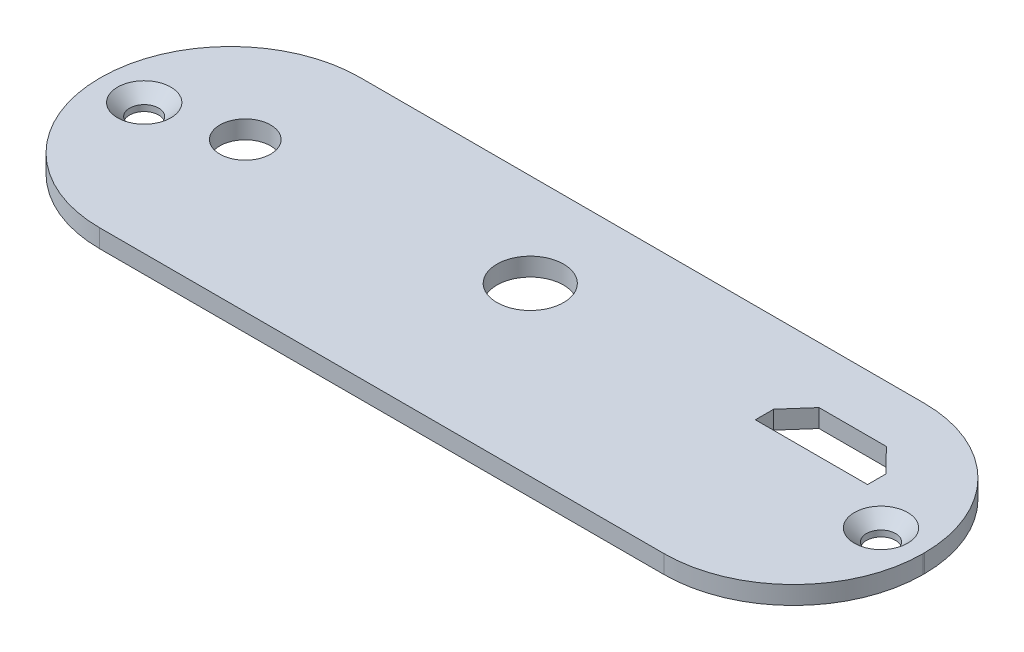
ISO-10303-21;
HEADER;
FILE_DESCRIPTION(('STEP AP214'),'2;1');
FILE_NAME('part.step','',(''),(''),'','','');
FILE_SCHEMA(('AUTOMOTIVE_DESIGN { 1 0 10303 214 1 1 1 1 }'));
ENDSEC;
DATA;
#1=APPLICATION_CONTEXT('core data for automotive mechanical design processes');
#2=APPLICATION_PROTOCOL_DEFINITION('international standard','automotive_design',2000,#1);
#3=PRODUCT_CONTEXT('',#1,'mechanical');
#4=PRODUCT('Part','Part','',(#3));
#5=PRODUCT_RELATED_PRODUCT_CATEGORY('part','',(#4));
#6=PRODUCT_DEFINITION_FORMATION('','',#4);
#7=PRODUCT_DEFINITION_CONTEXT('part definition',#1,'design');
#8=PRODUCT_DEFINITION('design','',#6,#7);
#9=PRODUCT_DEFINITION_SHAPE('','',#8);
#10=(LENGTH_UNIT() NAMED_UNIT(*) SI_UNIT(.MILLI.,.METRE.));
#11=(NAMED_UNIT(*) PLANE_ANGLE_UNIT() SI_UNIT($,.RADIAN.));
#12=(NAMED_UNIT(*) SI_UNIT($,.STERADIAN.) SOLID_ANGLE_UNIT());
#13=UNCERTAINTY_MEASURE_WITH_UNIT(LENGTH_MEASURE(1.E-05),#10,'distance_accuracy_value','');
#14=(GEOMETRIC_REPRESENTATION_CONTEXT(3) GLOBAL_UNCERTAINTY_ASSIGNED_CONTEXT((#13)) GLOBAL_UNIT_ASSIGNED_CONTEXT((#10,
#11,#12)) REPRESENTATION_CONTEXT('',''));
#15=CARTESIAN_POINT('',(0.,0.,0.));
#16=DIRECTION('',(0.,0.,1.));
#17=DIRECTION('',(1.,0.,0.));
#18=AXIS2_PLACEMENT_3D('',#15,#16,#17);
#19=CARTESIAN_POINT('',(10.7,1.5,-10.7));
#20=DIRECTION('',(0.,-1.,0.));
#21=DIRECTION('',(0.,0.,-1.));
#22=AXIS2_PLACEMENT_3D('',#19,#20,#21);
#23=CYLINDRICAL_SURFACE('',#22,10.7);
#24=CARTESIAN_POINT('',(10.7,0.,-10.7));
#25=DIRECTION('',(0.,1.,0.));
#26=DIRECTION('',(0.,0.,-1.));
#27=AXIS2_PLACEMENT_3D('',#24,#25,#26);
#28=CIRCLE('',#27,10.7);
#29=CARTESIAN_POINT('',(0.,0.,-10.7000000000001));
#30=VERTEX_POINT('',#29);
#31=CARTESIAN_POINT('',(10.7000000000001,0.,0.));
#32=VERTEX_POINT('',#31);
#33=EDGE_CURVE('E250',#30,#32,#28,.T.);
#34=ORIENTED_EDGE('',*,*,#33,.T.);
#35=DIRECTION('',(0.,-1.,0.));
#36=VECTOR('',#35,1.);
#37=CARTESIAN_POINT('',(10.7000000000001,1.5,0.));
#38=LINE('',#37,#36);
#39=CARTESIAN_POINT('',(10.7000000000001,1.5,0.));
#40=VERTEX_POINT('',#39);
#41=EDGE_CURVE('E11',#40,#32,#38,.T.);
#42=ORIENTED_EDGE('',*,*,#41,.F.);
#43=CARTESIAN_POINT('',(10.7,1.5,-10.7));
#44=DIRECTION('',(0.,1.,0.));
#45=DIRECTION('',(0.,0.,-1.));
#46=AXIS2_PLACEMENT_3D('',#43,#44,#45);
#47=CIRCLE('',#46,10.7);
#48=CARTESIAN_POINT('',(0.,1.5,-10.7000000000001));
#49=VERTEX_POINT('',#48);
#50=EDGE_CURVE('E251',#49,#40,#47,.T.);
#51=ORIENTED_EDGE('',*,*,#50,.F.);
#52=DIRECTION('',(0.,-1.,0.));
#53=VECTOR('',#52,1.);
#54=CARTESIAN_POINT('',(0.,1.5,-10.7000000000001));
#55=LINE('',#54,#53);
#56=EDGE_CURVE('E277',#49,#30,#55,.T.);
#57=ORIENTED_EDGE('',*,*,#56,.T.);
#58=EDGE_LOOP('',(#34,#42,#51,#57));
#59=FACE_BOUND('',#58,.T.);
#60=ADVANCED_FACE('F39',(#59),#23,.T.);
#61=CARTESIAN_POINT('',(10.7000000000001,1.5,0.));
#62=DIRECTION('',(0.,0.,-1.));
#63=DIRECTION('',(-1.,0.,0.));
#64=AXIS2_PLACEMENT_3D('',#61,#62,#63);
#65=PLANE('',#64);
#66=DIRECTION('',(1.,0.,0.));
#67=VECTOR('',#66,1.);
#68=CARTESIAN_POINT('',(10.7000000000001,0.,0.));
#69=LINE('',#68,#67);
#70=CARTESIAN_POINT('',(57.2999999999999,0.,0.));
#71=VERTEX_POINT('',#70);
#72=EDGE_CURVE('E281',#32,#71,#69,.T.);
#73=ORIENTED_EDGE('',*,*,#72,.T.);
#74=DIRECTION('',(0.,-1.,0.));
#75=VECTOR('',#74,1.);
#76=CARTESIAN_POINT('',(57.2999999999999,1.5,0.));
#77=LINE('',#76,#75);
#78=CARTESIAN_POINT('',(57.2999999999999,1.5,0.));
#79=VERTEX_POINT('',#78);
#80=EDGE_CURVE('E47',#79,#71,#77,.T.);
#81=ORIENTED_EDGE('',*,*,#80,.F.);
#82=DIRECTION('',(1.,0.,0.));
#83=VECTOR('',#82,1.);
#84=CARTESIAN_POINT('',(10.7000000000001,1.5,0.));
#85=LINE('',#84,#83);
#86=EDGE_CURVE('E255',#40,#79,#85,.T.);
#87=ORIENTED_EDGE('',*,*,#86,.F.);
#88=ORIENTED_EDGE('',*,*,#41,.T.);
#89=EDGE_LOOP('',(#73,#81,#87,#88));
#90=FACE_BOUND('',#89,.T.);
#91=ADVANCED_FACE('F351',(#90),#65,.F.);
#92=CARTESIAN_POINT('',(57.3,1.5,-10.7));
#93=DIRECTION('',(0.,-1.,0.));
#94=DIRECTION('',(0.,0.,-1.));
#95=AXIS2_PLACEMENT_3D('',#92,#93,#94);
#96=CYLINDRICAL_SURFACE('',#95,10.7);
#97=CARTESIAN_POINT('',(57.3,0.,-10.7));
#98=DIRECTION('',(0.,1.,0.));
#99=DIRECTION('',(0.,0.,1.));
#100=AXIS2_PLACEMENT_3D('',#97,#98,#99);
#101=CIRCLE('',#100,10.7);
#102=CARTESIAN_POINT('',(68.,0.,-10.7000000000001));
#103=VERTEX_POINT('',#102);
#104=EDGE_CURVE('E284',#71,#103,#101,.T.);
#105=ORIENTED_EDGE('',*,*,#104,.T.);
#106=DIRECTION('',(0.,-1.,0.));
#107=VECTOR('',#106,1.);
#108=CARTESIAN_POINT('',(68.,1.5,-10.7000000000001));
#109=LINE('',#108,#107);
#110=CARTESIAN_POINT('',(68.,1.5,-10.7000000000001));
#111=VERTEX_POINT('',#110);
#112=EDGE_CURVE('E320',#111,#103,#109,.T.);
#113=ORIENTED_EDGE('',*,*,#112,.F.);
#114=CARTESIAN_POINT('',(57.3,1.5,-10.7));
#115=DIRECTION('',(0.,1.,0.));
#116=DIRECTION('',(0.,0.,1.));
#117=AXIS2_PLACEMENT_3D('',#114,#115,#116);
#118=CIRCLE('',#117,10.7);
#119=EDGE_CURVE('E259',#79,#111,#118,.T.);
#120=ORIENTED_EDGE('',*,*,#119,.F.);
#121=ORIENTED_EDGE('',*,*,#80,.T.);
#122=EDGE_LOOP('',(#105,#113,#120,#121));
#123=FACE_BOUND('',#122,.T.);
#124=ADVANCED_FACE('F329',(#123),#96,.T.);
#125=CARTESIAN_POINT('',(68.,1.5,-10.7000000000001));
#126=DIRECTION('',(-1.,0.,0.));
#127=DIRECTION('',(0.,0.,1.));
#128=AXIS2_PLACEMENT_3D('',#125,#126,#127);
#129=PLANE('',#128);
#130=DIRECTION('',(0.,0.,-1.));
#131=VECTOR('',#130,1.);
#132=CARTESIAN_POINT('',(68.,0.,-10.7000000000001));
#133=LINE('',#132,#131);
#134=CARTESIAN_POINT('',(68.,0.,-10.7999999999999));
#135=VERTEX_POINT('',#134);
#136=EDGE_CURVE('E287',#103,#135,#133,.T.);
#137=ORIENTED_EDGE('',*,*,#136,.T.);
#138=DIRECTION('',(0.,-1.,0.));
#139=VECTOR('',#138,1.);
#140=CARTESIAN_POINT('',(68.,1.5,-10.7999999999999));
#141=LINE('',#140,#139);
#142=CARTESIAN_POINT('',(68.,1.5,-10.7999999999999));
#143=VERTEX_POINT('',#142);
#144=EDGE_CURVE('E316',#143,#135,#141,.T.);
#145=ORIENTED_EDGE('',*,*,#144,.F.);
#146=DIRECTION('',(0.,0.,-1.));
#147=VECTOR('',#146,1.);
#148=CARTESIAN_POINT('',(68.,1.5,-10.7000000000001));
#149=LINE('',#148,#147);
#150=EDGE_CURVE('E262',#111,#143,#149,.T.);
#151=ORIENTED_EDGE('',*,*,#150,.F.);
#152=ORIENTED_EDGE('',*,*,#112,.T.);
#153=EDGE_LOOP('',(#137,#145,#151,#152));
#154=FACE_BOUND('',#153,.T.);
#155=ADVANCED_FACE('F339',(#154),#129,.F.);
#156=CARTESIAN_POINT('',(57.3,1.5,-10.8));
#157=DIRECTION('',(0.,-1.,0.));
#158=DIRECTION('',(0.,0.,-1.));
#159=AXIS2_PLACEMENT_3D('',#156,#157,#158);
#160=CYLINDRICAL_SURFACE('',#159,10.7);
#161=CARTESIAN_POINT('',(57.3,0.,-10.8));
#162=DIRECTION('',(0.,1.,0.));
#163=DIRECTION('',(0.,0.,-1.));
#164=AXIS2_PLACEMENT_3D('',#161,#162,#163);
#165=CIRCLE('',#164,10.7);
#166=CARTESIAN_POINT('',(57.2999999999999,0.,-21.5));
#167=VERTEX_POINT('',#166);
#168=EDGE_CURVE('E290',#135,#167,#165,.T.);
#169=ORIENTED_EDGE('',*,*,#168,.T.);
#170=DIRECTION('',(0.,-1.,0.));
#171=VECTOR('',#170,1.);
#172=CARTESIAN_POINT('',(57.2999999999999,1.5,-21.5));
#173=LINE('',#172,#171);
#174=CARTESIAN_POINT('',(57.2999999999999,1.5,-21.5));
#175=VERTEX_POINT('',#174);
#176=EDGE_CURVE('E312',#175,#167,#173,.T.);
#177=ORIENTED_EDGE('',*,*,#176,.F.);
#178=CARTESIAN_POINT('',(57.3,1.5,-10.8));
#179=DIRECTION('',(0.,1.,0.));
#180=DIRECTION('',(0.,0.,-1.));
#181=AXIS2_PLACEMENT_3D('',#178,#179,#180);
#182=CIRCLE('',#181,10.7);
#183=EDGE_CURVE('E265',#143,#175,#182,.T.);
#184=ORIENTED_EDGE('',*,*,#183,.F.);
#185=ORIENTED_EDGE('',*,*,#144,.T.);
#186=EDGE_LOOP('',(#169,#177,#184,#185));
#187=FACE_BOUND('',#186,.T.);
#188=ADVANCED_FACE('F343',(#187),#160,.T.);
#189=CARTESIAN_POINT('',(10.7000000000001,1.5,-21.5));
#190=DIRECTION('',(0.,0.,1.));
#191=DIRECTION('',(1.,0.,0.));
#192=AXIS2_PLACEMENT_3D('',#189,#190,#191);
#193=PLANE('',#192);
#194=DIRECTION('',(-1.,0.,0.));
#195=VECTOR('',#194,1.);
#196=CARTESIAN_POINT('',(10.7000000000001,0.,-21.5));
#197=LINE('',#196,#195);
#198=CARTESIAN_POINT('',(10.7000000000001,0.,-21.5));
#199=VERTEX_POINT('',#198);
#200=EDGE_CURVE('E293',#167,#199,#197,.T.);
#201=ORIENTED_EDGE('',*,*,#200,.T.);
#202=DIRECTION('',(0.,-1.,0.));
#203=VECTOR('',#202,1.);
#204=CARTESIAN_POINT('',(10.7000000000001,1.5,-21.5));
#205=LINE('',#204,#203);
#206=CARTESIAN_POINT('',(10.7000000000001,1.5,-21.5));
#207=VERTEX_POINT('',#206);
#208=EDGE_CURVE('E308',#207,#199,#205,.T.);
#209=ORIENTED_EDGE('',*,*,#208,.F.);
#210=DIRECTION('',(-1.,0.,0.));
#211=VECTOR('',#210,1.);
#212=CARTESIAN_POINT('',(10.7000000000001,1.5,-21.5));
#213=LINE('',#212,#211);
#214=EDGE_CURVE('E268',#175,#207,#213,.T.);
#215=ORIENTED_EDGE('',*,*,#214,.F.);
#216=ORIENTED_EDGE('',*,*,#176,.T.);
#217=EDGE_LOOP('',(#201,#209,#215,#216));
#218=FACE_BOUND('',#217,.T.);
#219=ADVANCED_FACE('F364',(#218),#193,.F.);
#220=CARTESIAN_POINT('',(10.7,1.5,-10.8));
#221=DIRECTION('',(0.,-1.,0.));
#222=DIRECTION('',(0.,0.,-1.));
#223=AXIS2_PLACEMENT_3D('',#220,#221,#222);
#224=CYLINDRICAL_SURFACE('',#223,10.7);
#225=CARTESIAN_POINT('',(10.7,0.,-10.8));
#226=DIRECTION('',(0.,1.,0.));
#227=DIRECTION('',(0.,0.,-1.));
#228=AXIS2_PLACEMENT_3D('',#225,#226,#227);
#229=CIRCLE('',#228,10.7);
#230=CARTESIAN_POINT('',(0.,0.,-10.7999999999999));
#231=VERTEX_POINT('',#230);
#232=EDGE_CURVE('E296',#199,#231,#229,.T.);
#233=ORIENTED_EDGE('',*,*,#232,.T.);
#234=DIRECTION('',(0.,-1.,0.));
#235=VECTOR('',#234,1.);
#236=CARTESIAN_POINT('',(0.,1.5,-10.7999999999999));
#237=LINE('',#236,#235);
#238=CARTESIAN_POINT('',(0.,1.5,-10.7999999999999));
#239=VERTEX_POINT('',#238);
#240=EDGE_CURVE('E304',#239,#231,#237,.T.);
#241=ORIENTED_EDGE('',*,*,#240,.F.);
#242=CARTESIAN_POINT('',(10.7,1.5,-10.8));
#243=DIRECTION('',(0.,1.,0.));
#244=DIRECTION('',(0.,0.,-1.));
#245=AXIS2_PLACEMENT_3D('',#242,#243,#244);
#246=CIRCLE('',#245,10.7);
#247=EDGE_CURVE('E271',#207,#239,#246,.T.);
#248=ORIENTED_EDGE('',*,*,#247,.F.);
#249=ORIENTED_EDGE('',*,*,#208,.T.);
#250=EDGE_LOOP('',(#233,#241,#248,#249));
#251=FACE_BOUND('',#250,.T.);
#252=ADVANCED_FACE('F362',(#251),#224,.T.);
#253=CARTESIAN_POINT('',(0.,1.5,-10.7000000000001));
#254=DIRECTION('',(1.,0.,0.));
#255=DIRECTION('',(0.,0.,-1.));
#256=AXIS2_PLACEMENT_3D('',#253,#254,#255);
#257=PLANE('',#256);
#258=DIRECTION('',(0.,0.,1.));
#259=VECTOR('',#258,1.);
#260=CARTESIAN_POINT('',(0.,0.,-10.7000000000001));
#261=LINE('',#260,#259);
#262=EDGE_CURVE('E256',#231,#30,#261,.T.);
#263=ORIENTED_EDGE('',*,*,#262,.T.);
#264=ORIENTED_EDGE('',*,*,#56,.F.);
#265=DIRECTION('',(0.,0.,1.));
#266=VECTOR('',#265,1.);
#267=CARTESIAN_POINT('',(0.,1.5,-10.7000000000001));
#268=LINE('',#267,#266);
#269=EDGE_CURVE('E274',#239,#49,#268,.T.);
#270=ORIENTED_EDGE('',*,*,#269,.F.);
#271=ORIENTED_EDGE('',*,*,#240,.T.);
#272=EDGE_LOOP('',(#263,#264,#270,#271));
#273=FACE_BOUND('',#272,.T.);
#274=ADVANCED_FACE('F357',(#273),#257,.F.);
#275=CARTESIAN_POINT('',(10.7,1.5,-10.7));
#276=DIRECTION('',(0.,-1.,0.));
#277=DIRECTION('',(0.,0.,-1.));
#278=AXIS2_PLACEMENT_3D('',#275,#276,#277);
#279=PLANE('',#278);
#280=DIRECTION('',(0.,0.,1.));
#281=VECTOR('',#280,1.);
#282=CARTESIAN_POINT('',(51.5046246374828,1.5,-13.3410056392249));
#283=LINE('',#282,#281);
#284=CARTESIAN_POINT('',(51.5046246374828,1.5,-14.8527326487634));
#285=VERTEX_POINT('',#284);
#286=CARTESIAN_POINT('',(51.5046246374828,1.5,-13.3410056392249));
#287=VERTEX_POINT('',#286);
#288=EDGE_CURVE('E182',#285,#287,#283,.T.);
#289=ORIENTED_EDGE('',*,*,#288,.F.);
#290=DIRECTION('',(-0.661343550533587,0.,0.750083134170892));
#291=VECTOR('',#290,1.);
#292=CARTESIAN_POINT('',(53.2602628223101,1.5,-16.8439437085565));
#293=LINE('',#292,#291);
#294=CARTESIAN_POINT('',(53.2602628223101,1.5,-16.8439437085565));
#295=VERTEX_POINT('',#294);
#296=EDGE_CURVE('E54',#295,#285,#293,.T.);
#297=ORIENTED_EDGE('',*,*,#296,.F.);
#298=DIRECTION('',(-1.,0.,0.));
#299=VECTOR('',#298,1.);
#300=CARTESIAN_POINT('',(53.2602628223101,1.5,-16.8439437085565));
#301=LINE('',#300,#299);
#302=CARTESIAN_POINT('',(58.8233118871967,1.5,-16.8439437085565));
#303=VERTEX_POINT('',#302);
#304=EDGE_CURVE('E162',#303,#295,#301,.T.);
#305=ORIENTED_EDGE('',*,*,#304,.F.);
#306=DIRECTION('',(-0.698847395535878,0.,-0.715270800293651));
#307=VECTOR('',#306,1.);
#308=CARTESIAN_POINT('',(60.7688025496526,1.5,-14.8527326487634));
#309=LINE('',#308,#307);
#310=CARTESIAN_POINT('',(60.7688025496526,1.5,-14.8527326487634));
#311=VERTEX_POINT('',#310);
#312=EDGE_CURVE('E166',#311,#303,#309,.T.);
#313=ORIENTED_EDGE('',*,*,#312,.F.);
#314=DIRECTION('',(0.,0.,-1.));
#315=VECTOR('',#314,1.);
#316=CARTESIAN_POINT('',(60.7688025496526,1.5,-13.3410056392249));
#317=LINE('',#316,#315);
#318=CARTESIAN_POINT('',(60.7688025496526,1.5,-13.3410056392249));
#319=VERTEX_POINT('',#318);
#320=EDGE_CURVE('E190',#319,#311,#317,.T.);
#321=ORIENTED_EDGE('',*,*,#320,.F.);
#322=DIRECTION('',(1.,0.,0.));
#323=VECTOR('',#322,1.);
#324=CARTESIAN_POINT('',(60.7688025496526,1.5,-13.3410056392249));
#325=LINE('',#324,#323);
#326=EDGE_CURVE('E186',#287,#319,#325,.T.);
#327=ORIENTED_EDGE('',*,*,#326,.F.);
#328=EDGE_LOOP('',(#289,#297,#305,#313,#321,#327));
#329=FACE_BOUND('',#328,.T.);
#330=CARTESIAN_POINT('',(32.451482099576,1.5,-13.8069141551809));
#331=DIRECTION('',(0.,1.,0.));
#332=DIRECTION('',(0.,0.,1.));
#333=AXIS2_PLACEMENT_3D('',#330,#331,#332);
#334=CIRCLE('',#333,2.75154575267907);
#335=CARTESIAN_POINT('',(32.451482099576,1.5,-11.0553684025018));
#336=VERTEX_POINT('',#335);
#337=EDGE_CURVE('E215',#336,#336,#334,.T.);
#338=ORIENTED_EDGE('',*,*,#337,.F.);
#339=EDGE_LOOP('',(#338));
#340=FACE_BOUND('',#339,.T.);
#341=CARTESIAN_POINT('',(10.4,1.5,-12.32139708));
#342=DIRECTION('',(0.,1.,0.));
#343=DIRECTION('',(0.,0.,1.));
#344=AXIS2_PLACEMENT_3D('',#341,#342,#343);
#345=CIRCLE('',#344,2.09258907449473);
#346=CARTESIAN_POINT('',(10.4,1.5,-10.2288080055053));
#347=VERTEX_POINT('',#346);
#348=EDGE_CURVE('E223',#347,#347,#345,.T.);
#349=ORIENTED_EDGE('',*,*,#348,.F.);
#350=EDGE_LOOP('',(#349));
#351=FACE_BOUND('',#350,.T.);
#352=CARTESIAN_POINT('',(3.57803634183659,1.5,-10.7999999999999));
#353=DIRECTION('',(0.,1.,0.));
#354=DIRECTION('',(0.,0.,1.));
#355=AXIS2_PLACEMENT_3D('',#352,#353,#354);
#356=CIRCLE('',#355,2.2);
#357=CARTESIAN_POINT('',(3.57803634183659,1.5,-8.59999999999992));
#358=VERTEX_POINT('',#357);
#359=EDGE_CURVE('E200',#358,#358,#356,.T.);
#360=ORIENTED_EDGE('',*,*,#359,.F.);
#361=EDGE_LOOP('',(#360));
#362=FACE_BOUND('',#361,.T.);
#363=CARTESIAN_POINT('',(64.42357397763,1.5,-10.7999999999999));
#364=DIRECTION('',(0.,1.,0.));
#365=DIRECTION('',(0.,0.,1.));
#366=AXIS2_PLACEMENT_3D('',#363,#364,#365);
#367=CIRCLE('',#366,2.19999999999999);
#368=CARTESIAN_POINT('',(64.42357397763,1.5,-8.59999999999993));
#369=VERTEX_POINT('',#368);
#370=EDGE_CURVE('E238',#369,#369,#367,.T.);
#371=ORIENTED_EDGE('',*,*,#370,.F.);
#372=EDGE_LOOP('',(#371));
#373=FACE_BOUND('',#372,.T.);
#374=ORIENTED_EDGE('',*,*,#50,.T.);
#375=ORIENTED_EDGE('',*,*,#86,.T.);
#376=ORIENTED_EDGE('',*,*,#119,.T.);
#377=ORIENTED_EDGE('',*,*,#150,.T.);
#378=ORIENTED_EDGE('',*,*,#183,.T.);
#379=ORIENTED_EDGE('',*,*,#214,.T.);
#380=ORIENTED_EDGE('',*,*,#247,.T.);
#381=ORIENTED_EDGE('',*,*,#269,.T.);
#382=EDGE_LOOP('',(#374,#375,#376,#377,#378,#379,#380,#381));
#383=FACE_BOUND('',#382,.T.);
#384=ADVANCED_FACE('F347',(#329,#340,#351,#362,#373,#383),#279,.F.);
#385=CARTESIAN_POINT('',(10.7,0.,-10.7));
#386=DIRECTION('',(0.,-1.,0.));
#387=DIRECTION('',(0.,0.,-1.));
#388=AXIS2_PLACEMENT_3D('',#385,#386,#387);
#389=PLANE('',#388);
#390=DIRECTION('',(-0.661343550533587,0.,0.750083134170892));
#391=VECTOR('',#390,1.);
#392=CARTESIAN_POINT('',(53.2602628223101,0.,-16.8439437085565));
#393=LINE('',#392,#391);
#394=CARTESIAN_POINT('',(53.2602628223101,0.,-16.8439437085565));
#395=VERTEX_POINT('',#394);
#396=CARTESIAN_POINT('',(51.5046246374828,0.,-14.8527326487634));
#397=VERTEX_POINT('',#396);
#398=EDGE_CURVE('E142',#395,#397,#393,.T.);
#399=ORIENTED_EDGE('',*,*,#398,.T.);
#400=DIRECTION('',(0.,0.,1.));
#401=VECTOR('',#400,1.);
#402=CARTESIAN_POINT('',(51.5046246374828,0.,-13.3410056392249));
#403=LINE('',#402,#401);
#404=CARTESIAN_POINT('',(51.5046246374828,0.,-13.3410056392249));
#405=VERTEX_POINT('',#404);
#406=EDGE_CURVE('E152',#397,#405,#403,.T.);
#407=ORIENTED_EDGE('',*,*,#406,.T.);
#408=DIRECTION('',(1.,0.,0.));
#409=VECTOR('',#408,1.);
#410=CARTESIAN_POINT('',(60.7688025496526,0.,-13.3410056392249));
#411=LINE('',#410,#409);
#412=CARTESIAN_POINT('',(60.7688025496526,0.,-13.3410056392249));
#413=VERTEX_POINT('',#412);
#414=EDGE_CURVE('E62',#405,#413,#411,.T.);
#415=ORIENTED_EDGE('',*,*,#414,.T.);
#416=DIRECTION('',(0.,0.,-1.));
#417=VECTOR('',#416,1.);
#418=CARTESIAN_POINT('',(60.7688025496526,0.,-13.3410056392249));
#419=LINE('',#418,#417);
#420=CARTESIAN_POINT('',(60.7688025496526,0.,-14.8527326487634));
#421=VERTEX_POINT('',#420);
#422=EDGE_CURVE('E171',#413,#421,#419,.T.);
#423=ORIENTED_EDGE('',*,*,#422,.T.);
#424=DIRECTION('',(-0.698847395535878,0.,-0.715270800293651));
#425=VECTOR('',#424,1.);
#426=CARTESIAN_POINT('',(60.7688025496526,0.,-14.8527326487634));
#427=LINE('',#426,#425);
#428=CARTESIAN_POINT('',(58.8233118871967,0.,-16.8439437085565));
#429=VERTEX_POINT('',#428);
#430=EDGE_CURVE('E175',#421,#429,#427,.T.);
#431=ORIENTED_EDGE('',*,*,#430,.T.);
#432=DIRECTION('',(-1.,0.,0.));
#433=VECTOR('',#432,1.);
#434=CARTESIAN_POINT('',(53.2602628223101,0.,-16.8439437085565));
#435=LINE('',#434,#433);
#436=EDGE_CURVE('E149',#429,#395,#435,.T.);
#437=ORIENTED_EDGE('',*,*,#436,.T.);
#438=EDGE_LOOP('',(#399,#407,#415,#423,#431,#437));
#439=FACE_BOUND('',#438,.T.);
#440=CARTESIAN_POINT('',(32.451482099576,0.,-13.8069141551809));
#441=DIRECTION('',(0.,1.,0.));
#442=DIRECTION('',(0.,0.,1.));
#443=AXIS2_PLACEMENT_3D('',#440,#441,#442);
#444=CIRCLE('',#443,2.75154575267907);
#445=CARTESIAN_POINT('',(32.451482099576,0.,-11.0553684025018));
#446=VERTEX_POINT('',#445);
#447=EDGE_CURVE('E183',#446,#446,#444,.T.);
#448=ORIENTED_EDGE('',*,*,#447,.T.);
#449=EDGE_LOOP('',(#448));
#450=FACE_BOUND('',#449,.T.);
#451=CARTESIAN_POINT('',(10.4,0.,-12.32139708));
#452=DIRECTION('',(0.,1.,0.));
#453=DIRECTION('',(0.,0.,1.));
#454=AXIS2_PLACEMENT_3D('',#451,#452,#453);
#455=CIRCLE('',#454,2.09258907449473);
#456=CARTESIAN_POINT('',(10.4,0.,-10.2288080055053));
#457=VERTEX_POINT('',#456);
#458=EDGE_CURVE('E219',#457,#457,#455,.T.);
#459=ORIENTED_EDGE('',*,*,#458,.T.);
#460=EDGE_LOOP('',(#459));
#461=FACE_BOUND('',#460,.T.);
#462=CARTESIAN_POINT('',(3.57803634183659,0.,-10.7999999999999));
#463=DIRECTION('',(0.,1.,0.));
#464=DIRECTION('',(0.,0.,1.));
#465=AXIS2_PLACEMENT_3D('',#462,#463,#464);
#466=CIRCLE('',#465,1.2);
#467=CARTESIAN_POINT('',(3.57803634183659,0.,-9.59999999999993));
#468=VERTEX_POINT('',#467);
#469=EDGE_CURVE('E234',#468,#468,#466,.T.);
#470=ORIENTED_EDGE('',*,*,#469,.T.);
#471=EDGE_LOOP('',(#470));
#472=FACE_BOUND('',#471,.T.);
#473=CARTESIAN_POINT('',(64.42357397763,0.,-10.7999999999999));
#474=DIRECTION('',(0.,1.,0.));
#475=DIRECTION('',(0.,0.,1.));
#476=AXIS2_PLACEMENT_3D('',#473,#474,#475);
#477=CIRCLE('',#476,1.19999999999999);
#478=CARTESIAN_POINT('',(64.42357397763,0.,-9.59999999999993));
#479=VERTEX_POINT('',#478);
#480=EDGE_CURVE('E246',#479,#479,#477,.T.);
#481=ORIENTED_EDGE('',*,*,#480,.T.);
#482=EDGE_LOOP('',(#481));
#483=FACE_BOUND('',#482,.T.);
#484=ORIENTED_EDGE('',*,*,#33,.F.);
#485=ORIENTED_EDGE('',*,*,#262,.F.);
#486=ORIENTED_EDGE('',*,*,#232,.F.);
#487=ORIENTED_EDGE('',*,*,#200,.F.);
#488=ORIENTED_EDGE('',*,*,#168,.F.);
#489=ORIENTED_EDGE('',*,*,#136,.F.);
#490=ORIENTED_EDGE('',*,*,#104,.F.);
#491=ORIENTED_EDGE('',*,*,#72,.F.);
#492=EDGE_LOOP('',(#484,#485,#486,#487,#488,#489,#490,#491));
#493=FACE_BOUND('',#492,.T.);
#494=ADVANCED_FACE('F157',(#439,#450,#461,#472,#483,#493),#389,.T.);
#495=CARTESIAN_POINT('',(64.42357397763,1.5,-10.7999999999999));
#496=DIRECTION('',(0.,1.,0.));
#497=DIRECTION('',(0.,0.,1.));
#498=AXIS2_PLACEMENT_3D('',#495,#496,#497);
#499=CYLINDRICAL_SURFACE('',#498,1.19999999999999);
#500=ORIENTED_EDGE('',*,*,#480,.F.);
#501=EDGE_LOOP('',(#500));
#502=FACE_BOUND('',#501,.T.);
#503=CARTESIAN_POINT('',(64.42357397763,0.499999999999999,-10.7999999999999));
#504=DIRECTION('',(0.,1.,0.));
#505=DIRECTION('',(0.,0.,1.));
#506=AXIS2_PLACEMENT_3D('',#503,#504,#505);
#507=CIRCLE('',#506,1.19999999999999);
#508=CARTESIAN_POINT('',(64.42357397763,0.499999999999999,-9.59999999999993));
#509=VERTEX_POINT('',#508);
#510=EDGE_CURVE('E242',#509,#509,#507,.T.);
#511=ORIENTED_EDGE('',*,*,#510,.T.);
#512=EDGE_LOOP('',(#511));
#513=FACE_BOUND('',#512,.T.);
#514=ADVANCED_FACE('F416',(#502,#513),#499,.F.);
#515=CARTESIAN_POINT('',(64.42357397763,1.5,-10.7999999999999));
#516=DIRECTION('',(0.,1.,0.));
#517=DIRECTION('',(0.,0.,1.));
#518=AXIS2_PLACEMENT_3D('',#515,#516,#517);
#519=CONICAL_SURFACE('',#518,2.19999999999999,0.785398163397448);
#520=ORIENTED_EDGE('',*,*,#510,.F.);
#521=EDGE_LOOP('',(#520));
#522=FACE_BOUND('',#521,.T.);
#523=ORIENTED_EDGE('',*,*,#370,.T.);
#524=EDGE_LOOP('',(#523));
#525=FACE_BOUND('',#524,.T.);
#526=ADVANCED_FACE('F421',(#522,#525),#519,.F.);
#527=CARTESIAN_POINT('',(3.57803634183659,1.5,-10.7999999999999));
#528=DIRECTION('',(0.,1.,0.));
#529=DIRECTION('',(0.,0.,1.));
#530=AXIS2_PLACEMENT_3D('',#527,#528,#529);
#531=CYLINDRICAL_SURFACE('',#530,1.2);
#532=ORIENTED_EDGE('',*,*,#469,.F.);
#533=EDGE_LOOP('',(#532));
#534=FACE_BOUND('',#533,.T.);
#535=CARTESIAN_POINT('',(3.57803634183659,0.499999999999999,-10.7999999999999));
#536=DIRECTION('',(0.,1.,0.));
#537=DIRECTION('',(0.,0.,1.));
#538=AXIS2_PLACEMENT_3D('',#535,#536,#537);
#539=CIRCLE('',#538,1.2);
#540=CARTESIAN_POINT('',(3.57803634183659,0.499999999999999,-9.59999999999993));
#541=VERTEX_POINT('',#540);
#542=EDGE_CURVE('E230',#541,#541,#539,.T.);
#543=ORIENTED_EDGE('',*,*,#542,.T.);
#544=EDGE_LOOP('',(#543));
#545=FACE_BOUND('',#544,.T.);
#546=ADVANCED_FACE('F433',(#534,#545),#531,.F.);
#547=CARTESIAN_POINT('',(3.57803634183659,1.5,-10.7999999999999));
#548=DIRECTION('',(0.,1.,0.));
#549=DIRECTION('',(0.,0.,1.));
#550=AXIS2_PLACEMENT_3D('',#547,#548,#549);
#551=CONICAL_SURFACE('',#550,2.2,0.785398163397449);
#552=ORIENTED_EDGE('',*,*,#542,.F.);
#553=EDGE_LOOP('',(#552));
#554=FACE_BOUND('',#553,.T.);
#555=ORIENTED_EDGE('',*,*,#359,.T.);
#556=EDGE_LOOP('',(#555));
#557=FACE_BOUND('',#556,.T.);
#558=ADVANCED_FACE('F443',(#554,#557),#551,.F.);
#559=CARTESIAN_POINT('',(10.4,0.,-12.32139708));
#560=DIRECTION('',(0.,1.,0.));
#561=DIRECTION('',(0.,0.,1.));
#562=AXIS2_PLACEMENT_3D('',#559,#560,#561);
#563=CYLINDRICAL_SURFACE('',#562,2.09258907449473);
#564=ORIENTED_EDGE('',*,*,#458,.F.);
#565=EDGE_LOOP('',(#564));
#566=FACE_BOUND('',#565,.T.);
#567=ORIENTED_EDGE('',*,*,#348,.T.);
#568=EDGE_LOOP('',(#567));
#569=FACE_BOUND('',#568,.T.);
#570=ADVANCED_FACE('F453',(#566,#569),#563,.F.);
#571=CARTESIAN_POINT('',(32.451482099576,0.,-13.8069141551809));
#572=DIRECTION('',(0.,1.,0.));
#573=DIRECTION('',(0.,0.,1.));
#574=AXIS2_PLACEMENT_3D('',#571,#572,#573);
#575=CYLINDRICAL_SURFACE('',#574,2.75154575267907);
#576=ORIENTED_EDGE('',*,*,#447,.F.);
#577=EDGE_LOOP('',(#576));
#578=FACE_BOUND('',#577,.T.);
#579=ORIENTED_EDGE('',*,*,#337,.T.);
#580=EDGE_LOOP('',(#579));
#581=FACE_BOUND('',#580,.T.);
#582=ADVANCED_FACE('F476',(#578,#581),#575,.F.);
#583=CARTESIAN_POINT('',(53.2602628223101,0.,-16.8439437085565));
#584=DIRECTION('',(-0.750083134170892,0.,-0.661343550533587));
#585=DIRECTION('',(-0.661343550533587,0.,0.750083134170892));
#586=AXIS2_PLACEMENT_3D('',#583,#584,#585);
#587=PLANE('',#586);
#588=ORIENTED_EDGE('',*,*,#296,.T.);
#589=DIRECTION('',(0.,1.,0.));
#590=VECTOR('',#589,1.);
#591=CARTESIAN_POINT('',(51.5046246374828,0.,-14.8527326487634));
#592=LINE('',#591,#590);
#593=EDGE_CURVE('E138',#397,#285,#592,.T.);
#594=ORIENTED_EDGE('',*,*,#593,.F.);
#595=ORIENTED_EDGE('',*,*,#398,.F.);
#596=DIRECTION('',(0.,1.,0.));
#597=VECTOR('',#596,1.);
#598=CARTESIAN_POINT('',(53.2602628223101,0.,-16.8439437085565));
#599=LINE('',#598,#597);
#600=EDGE_CURVE('E197',#395,#295,#599,.T.);
#601=ORIENTED_EDGE('',*,*,#600,.T.);
#602=EDGE_LOOP('',(#588,#594,#595,#601));
#603=FACE_BOUND('',#602,.T.);
#604=ADVANCED_FACE('F140',(#603),#587,.F.);
#605=CARTESIAN_POINT('',(53.2602628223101,0.,-16.8439437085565));
#606=DIRECTION('',(0.,0.,-1.));
#607=DIRECTION('',(-1.,0.,0.));
#608=AXIS2_PLACEMENT_3D('',#605,#606,#607);
#609=PLANE('',#608);
#610=ORIENTED_EDGE('',*,*,#304,.T.);
#611=ORIENTED_EDGE('',*,*,#600,.F.);
#612=ORIENTED_EDGE('',*,*,#436,.F.);
#613=DIRECTION('',(0.,1.,0.));
#614=VECTOR('',#613,1.);
#615=CARTESIAN_POINT('',(58.8233118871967,0.,-16.8439437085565));
#616=LINE('',#615,#614);
#617=EDGE_CURVE('E201',#429,#303,#616,.T.);
#618=ORIENTED_EDGE('',*,*,#617,.T.);
#619=EDGE_LOOP('',(#610,#611,#612,#618));
#620=FACE_BOUND('',#619,.T.);
#621=ADVANCED_FACE('F495',(#620),#609,.F.);
#622=CARTESIAN_POINT('',(60.7688025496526,0.,-14.8527326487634));
#623=DIRECTION('',(0.715270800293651,0.,-0.698847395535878));
#624=DIRECTION('',(-0.698847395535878,0.,-0.715270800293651));
#625=AXIS2_PLACEMENT_3D('',#622,#623,#624);
#626=PLANE('',#625);
#627=ORIENTED_EDGE('',*,*,#312,.T.);
#628=ORIENTED_EDGE('',*,*,#617,.F.);
#629=ORIENTED_EDGE('',*,*,#430,.F.);
#630=DIRECTION('',(0.,1.,0.));
#631=VECTOR('',#630,1.);
#632=CARTESIAN_POINT('',(60.7688025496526,0.,-14.8527326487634));
#633=LINE('',#632,#631);
#634=EDGE_CURVE('E204',#421,#311,#633,.T.);
#635=ORIENTED_EDGE('',*,*,#634,.T.);
#636=EDGE_LOOP('',(#627,#628,#629,#635));
#637=FACE_BOUND('',#636,.T.);
#638=ADVANCED_FACE('F504',(#637),#626,.F.);
#639=CARTESIAN_POINT('',(60.7688025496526,0.,-13.3410056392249));
#640=DIRECTION('',(1.,0.,0.));
#641=DIRECTION('',(0.,0.,-1.));
#642=AXIS2_PLACEMENT_3D('',#639,#640,#641);
#643=PLANE('',#642);
#644=ORIENTED_EDGE('',*,*,#320,.T.);
#645=ORIENTED_EDGE('',*,*,#634,.F.);
#646=ORIENTED_EDGE('',*,*,#422,.F.);
#647=DIRECTION('',(0.,1.,0.));
#648=VECTOR('',#647,1.);
#649=CARTESIAN_POINT('',(60.7688025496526,0.,-13.3410056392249));
#650=LINE('',#649,#648);
#651=EDGE_CURVE('E207',#413,#319,#650,.T.);
#652=ORIENTED_EDGE('',*,*,#651,.T.);
#653=EDGE_LOOP('',(#644,#645,#646,#652));
#654=FACE_BOUND('',#653,.T.);
#655=ADVANCED_FACE('F514',(#654),#643,.F.);
#656=CARTESIAN_POINT('',(60.7688025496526,0.,-13.3410056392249));
#657=DIRECTION('',(0.,0.,1.));
#658=DIRECTION('',(1.,0.,0.));
#659=AXIS2_PLACEMENT_3D('',#656,#657,#658);
#660=PLANE('',#659);
#661=ORIENTED_EDGE('',*,*,#326,.T.);
#662=ORIENTED_EDGE('',*,*,#651,.F.);
#663=ORIENTED_EDGE('',*,*,#414,.F.);
#664=DIRECTION('',(0.,1.,0.));
#665=VECTOR('',#664,1.);
#666=CARTESIAN_POINT('',(51.5046246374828,0.,-13.3410056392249));
#667=LINE('',#666,#665);
#668=EDGE_CURVE('E148',#405,#287,#667,.T.);
#669=ORIENTED_EDGE('',*,*,#668,.T.);
#670=EDGE_LOOP('',(#661,#662,#663,#669));
#671=FACE_BOUND('',#670,.T.);
#672=ADVANCED_FACE('F524',(#671),#660,.F.);
#673=CARTESIAN_POINT('',(51.5046246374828,0.,-13.3410056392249));
#674=DIRECTION('',(-1.,0.,0.));
#675=DIRECTION('',(0.,0.,1.));
#676=AXIS2_PLACEMENT_3D('',#673,#674,#675);
#677=PLANE('',#676);
#678=ORIENTED_EDGE('',*,*,#288,.T.);
#679=ORIENTED_EDGE('',*,*,#668,.F.);
#680=ORIENTED_EDGE('',*,*,#406,.F.);
#681=ORIENTED_EDGE('',*,*,#593,.T.);
#682=EDGE_LOOP('',(#678,#679,#680,#681));
#683=FACE_BOUND('',#682,.T.);
#684=ADVANCED_FACE('F153',(#683),#677,.F.);
#685=CLOSED_SHELL('',(#60,#91,#124,#155,#188,#219,#252,#274,#384,#494,#514,#526,#546,#558,#570,
#582,#604,#621,#638,#655,#672,#684));
#686=MANIFOLD_SOLID_BREP('B2',#685);
#687=ADVANCED_BREP_SHAPE_REPRESENTATION('',(#18,#686),#14);
#688=SHAPE_DEFINITION_REPRESENTATION(#9,#687);
ENDSEC;
END-ISO-10303-21;
